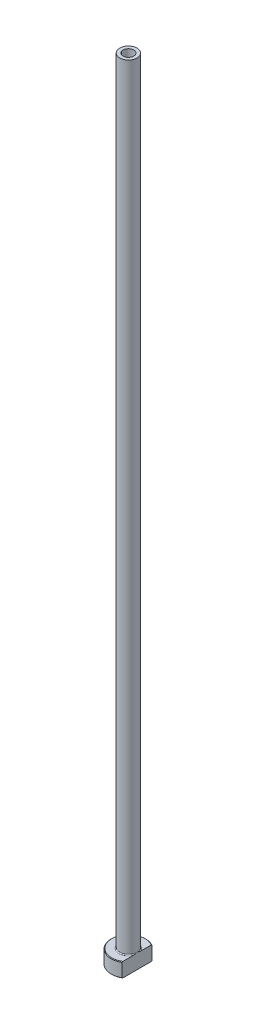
from build123d import *

# Parameters (mm, degrees)
FILLET1_R          = 0.3
CHAMFER1_SIZE      = 0.2
CUT_EXTRUDE1_DEPTH = 276.130877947
CHAMFER2_SIZE      = 0.5


with BuildPart() as part:
    # Sketch1 → Revolve1 (revolve)
    with BuildSketch(Plane.XY, mode=Mode.PRIVATE) as revolve1_sk:
        Polygon((-1.85, 275), (-3, 275), (-3, 5), (-6, 5), (-6, 0), (-2.1, 0), (-2.1, 218), (-1.85, 230), align=None)
    revolve(revolve1_sk.sketch.rotate(Axis((0, 92.187680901, 0), (0, -1, 0)), 270), axis=Axis((0, 92.187680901, 0), (0, -1, 0)))

    # Fillet1
    fillet1_edges = [part.edges().sort_by_distance(p)[0] for p in [
        (0, 5, -3),
    ]]
    fillet(fillet1_edges, radius=FILLET1_R)

    # Chamfer1
    chamfer1_edges = [part.edges().sort_by_distance(p)[0] for p in [
        (0, 0, -6),
        (0, 5, -6),
    ]]
    chamfer(chamfer1_edges, length=CHAMFER1_SIZE)

    # Sketch2 → Cut-Extrude1 (cut, through all)
    with BuildSketch(Plane.XZ):
        with BuildLine():
            Line((3, 5.196152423), (3, -5.196152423))
            ThreePointArc((3, -5.196152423), (6, 0), (3, 5.196152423))
        make_face()
    extrude(amount=-CUT_EXTRUDE1_DEPTH, mode=Mode.SUBTRACT)

    # Chamfer2
    chamfer2_edges = [part.edges().sort_by_distance(p)[0] for p in [
        (0, 0, -2.1),
    ]]
    chamfer(chamfer2_edges, length=CHAMFER2_SIZE)


solid = part.part
